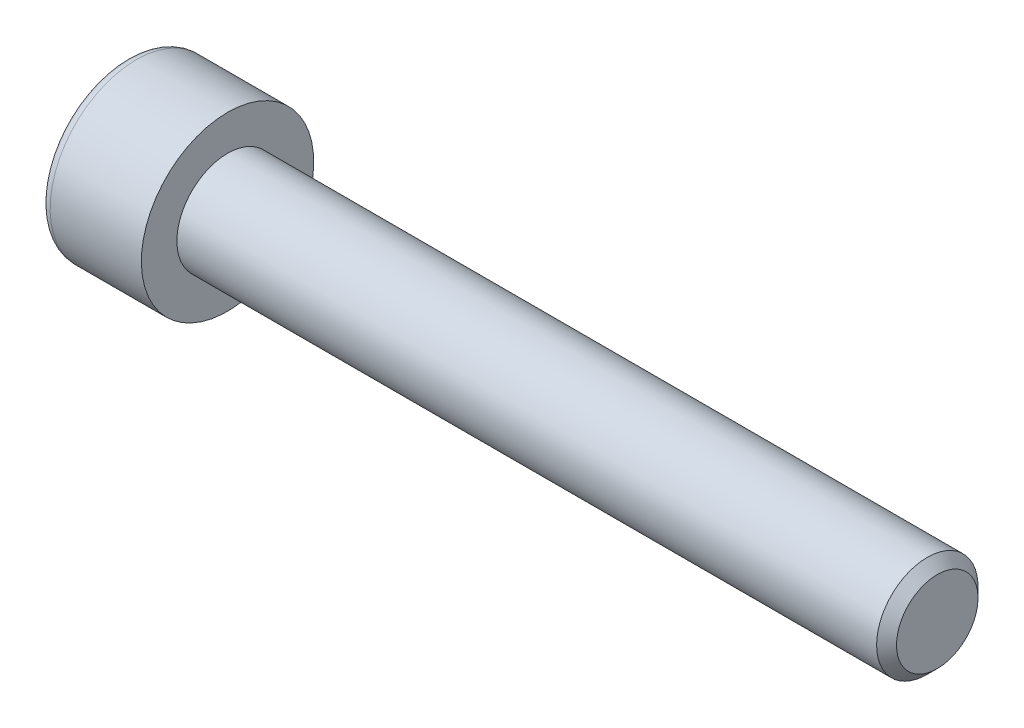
ISO-10303-21;
HEADER;
FILE_DESCRIPTION(('STEP AP214'),'2;1');
FILE_NAME('part.step','',(''),(''),'','','');
FILE_SCHEMA(('AUTOMOTIVE_DESIGN { 1 0 10303 214 1 1 1 1 }'));
ENDSEC;
DATA;
#1=APPLICATION_CONTEXT('core data for automotive mechanical design processes');
#2=APPLICATION_PROTOCOL_DEFINITION('international standard','automotive_design',2000,#1);
#3=PRODUCT_CONTEXT('',#1,'mechanical');
#4=PRODUCT('Part','Part','',(#3));
#5=PRODUCT_RELATED_PRODUCT_CATEGORY('part','',(#4));
#6=PRODUCT_DEFINITION_FORMATION('','',#4);
#7=PRODUCT_DEFINITION_CONTEXT('part definition',#1,'design');
#8=PRODUCT_DEFINITION('design','',#6,#7);
#9=PRODUCT_DEFINITION_SHAPE('','',#8);
#10=(LENGTH_UNIT() NAMED_UNIT(*) SI_UNIT(.MILLI.,.METRE.));
#11=(NAMED_UNIT(*) PLANE_ANGLE_UNIT() SI_UNIT($,.RADIAN.));
#12=(NAMED_UNIT(*) SI_UNIT($,.STERADIAN.) SOLID_ANGLE_UNIT());
#13=UNCERTAINTY_MEASURE_WITH_UNIT(LENGTH_MEASURE(1.E-05),#10,'distance_accuracy_value','');
#14=(GEOMETRIC_REPRESENTATION_CONTEXT(3) GLOBAL_UNCERTAINTY_ASSIGNED_CONTEXT((#13)) GLOBAL_UNIT_ASSIGNED_CONTEXT((#10,
#11,#12)) REPRESENTATION_CONTEXT('',''));
#15=CARTESIAN_POINT('',(0.,0.,0.));
#16=DIRECTION('',(0.,0.,1.));
#17=DIRECTION('',(1.,0.,0.));
#18=AXIS2_PLACEMENT_3D('',#15,#16,#17);
#19=CARTESIAN_POINT('',(-2.50800000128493,0.,0.));
#20=DIRECTION('',(-1.,0.,0.));
#21=DIRECTION('',(0.,0.,1.));
#22=AXIS2_PLACEMENT_3D('',#19,#20,#21);
#23=CONICAL_SURFACE('',#22,2.32325748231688,1.04719754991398);
#24=CARTESIAN_POINT('',(-1.16666666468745,-1.70530256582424E-10,0.));
#25=VERTEX_POINT('',#24);
#26=VERTEX_LOOP('',#25);
#27=FACE_BOUND('',#26,.T.);
#28=CARTESIAN_POINT('',(-2.50000000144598,2.00000000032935,1.15470053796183));
#29=CARTESIAN_POINT('',(-2.47069554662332,2.00000000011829,1.05321634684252));
#30=CARTESIAN_POINT('',(-2.44404467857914,2.00000000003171,0.950856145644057));
#31=CARTESIAN_POINT('',(-2.39752638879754,1.99999999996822,0.74436344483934));
#32=CARTESIAN_POINT('',(-2.37767542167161,1.99999999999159,0.640227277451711));
#33=CARTESIAN_POINT('',(-2.34677596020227,2.00000000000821,0.433245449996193));
#34=CARTESIAN_POINT('',(-2.33552178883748,2.00000000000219,0.330431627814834));
#35=CARTESIAN_POINT('',(-2.32208916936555,1.99999999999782,0.124320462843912));
#36=CARTESIAN_POINT('',(-2.31989959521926,1.99999999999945,0.0210238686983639));
#37=CARTESIAN_POINT('',(-2.32446629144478,2.00000000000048,-0.17197473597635));
#38=CARTESIAN_POINT('',(-2.33010128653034,2.00000000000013,-0.261705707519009));
#39=CARTESIAN_POINT('',(-2.34795730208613,1.99999999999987,-0.440583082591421));
#40=CARTESIAN_POINT('',(-2.36018441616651,1.99999999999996,-0.52972886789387));
#41=CARTESIAN_POINT('',(-2.39074983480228,2.00000000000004,-0.708974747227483));
#42=CARTESIAN_POINT('',(-2.40921764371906,2.00000000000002,-0.799052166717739));
#43=CARTESIAN_POINT('',(-2.45113176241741,1.99999999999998,-0.977863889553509));
#44=CARTESIAN_POINT('',(-2.47456823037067,1.99999999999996,-1.06660048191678));
#45=CARTESIAN_POINT('',(-2.50000000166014,2.,-1.15470053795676));
#46=B_SPLINE_CURVE_WITH_KNOTS('',3,(#28,#29,#30,#31,#32,#33,#34,#35,#36,#37,#38,#39,#40,#41,#42,
#43,#44,#45),.UNSPECIFIED.,.F.,.F.,(4,2,2,2,2,2,2,2,4),(0.,0.317016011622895,0.6347938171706,
0.944707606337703,1.25424088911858,1.52370778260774,1.79342419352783,2.06912162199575,
2.3442779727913),.UNSPECIFIED.);
#47=CARTESIAN_POINT('',(-2.50000000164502,1.99999999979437,1.15470053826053));
#48=VERTEX_POINT('',#47);
#49=CARTESIAN_POINT('',(-2.50000000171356,2.,-1.15470053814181));
#50=VERTEX_POINT('',#49);
#51=EDGE_CURVE('E20',#48,#50,#46,.T.);
#52=ORIENTED_EDGE('',*,*,#51,.T.);
#53=CARTESIAN_POINT('',(-2.50000000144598,1.99999999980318,-1.15470053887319));
#54=CARTESIAN_POINT('',(-2.47069554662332,1.91211211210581,-1.20544263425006));
#55=CARTESIAN_POINT('',(-2.44404467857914,1.82346557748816,-1.2566227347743));
#56=CARTESIAN_POINT('',(-2.39752638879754,1.64463765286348,-1.35986908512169));
#57=CARTESIAN_POINT('',(-2.37767542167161,1.55445308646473,-1.41193716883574));
#58=CARTESIAN_POINT('',(-2.34677596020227,1.37520156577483,-1.51542808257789));
#59=CARTESIAN_POINT('',(-2.33552178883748,1.28616218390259,-1.56683499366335));
#60=CARTESIAN_POINT('',(-2.32208916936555,1.10766467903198,-1.66989057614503));
#61=CARTESIAN_POINT('',(-2.31989959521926,1.01820720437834,-1.72153887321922));
#62=CARTESIAN_POINT('',(-2.32446629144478,0.851065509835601,-1.81803817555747));
#63=CARTESIAN_POINT('',(-2.33010128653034,0.773356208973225,-1.86290366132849));
#64=CARTESIAN_POINT('',(-2.34795730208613,0.61844385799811,-1.95234234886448));
#65=CARTESIAN_POINT('',(-2.36018441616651,0.541241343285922,-1.99691524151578));
#66=CARTESIAN_POINT('',(-2.39074983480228,0.38600985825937,-2.08653818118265));
#67=CARTESIAN_POINT('',(-2.40921764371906,0.30800052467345,-2.13157689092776));
#68=CARTESIAN_POINT('',(-2.45113176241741,0.153145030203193,-2.22098275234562));
#69=CARTESIAN_POINT('',(-2.47456823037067,0.0762968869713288,-2.26535104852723));
#70=CARTESIAN_POINT('',(-2.50000000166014,3.65892201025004E-10,-2.30940107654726));
#71=B_SPLINE_CURVE_WITH_KNOTS('',3,(#53,#54,#55,#56,#57,#58,#59,#60,#61,#62,#63,#64,#65,#66,#67,
#68,#69,#70),.UNSPECIFIED.,.F.,.F.,(4,2,2,2,2,2,2,2,4),(0.,0.317016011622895,0.634793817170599,
0.944707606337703,1.25424088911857,1.52370778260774,1.79342419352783,2.06912162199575,
2.3442779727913),.UNSPECIFIED.);
#72=CARTESIAN_POINT('',(-2.50000000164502,0.,-2.30940107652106));
#73=VERTEX_POINT('',#72);
#74=EDGE_CURVE('E80',#50,#73,#71,.T.);
#75=ORIENTED_EDGE('',*,*,#74,.T.);
#76=CARTESIAN_POINT('',(-2.50000000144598,-5.2617070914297E-10,-2.30940107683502));
#77=CARTESIAN_POINT('',(-2.47069554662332,-0.0878878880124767,-2.25865898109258));
#78=CARTESIAN_POINT('',(-2.44404467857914,-0.17653442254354,-2.20747888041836));
#79=CARTESIAN_POINT('',(-2.39752638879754,-0.355362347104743,-2.10423252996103));
#80=CARTESIAN_POINT('',(-2.37767542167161,-0.445546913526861,-2.05216444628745));
#81=CARTESIAN_POINT('',(-2.34677596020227,-0.624798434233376,-1.94867353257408));
#82=CARTESIAN_POINT('',(-2.33552178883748,-0.7138378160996,-1.89726662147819));
#83=CARTESIAN_POINT('',(-2.32208916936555,-0.892335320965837,-1.79421103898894));
#84=CARTESIAN_POINT('',(-2.31989959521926,-0.981792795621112,-1.74256274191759));
#85=CARTESIAN_POINT('',(-2.32446629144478,-1.14893449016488,-1.64606343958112));
#86=CARTESIAN_POINT('',(-2.33010128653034,-1.2266437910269,-1.60119795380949));
#87=CARTESIAN_POINT('',(-2.34795730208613,-1.38155614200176,-1.51175926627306));
#88=CARTESIAN_POINT('',(-2.36018441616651,-1.45875865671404,-1.46718637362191));
#89=CARTESIAN_POINT('',(-2.39074983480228,-1.61399014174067,-1.37756343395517));
#90=CARTESIAN_POINT('',(-2.40921764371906,-1.69199947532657,-1.33252472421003));
#91=CARTESIAN_POINT('',(-2.45113176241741,-1.84685496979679,-1.24311886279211));
#92=CARTESIAN_POINT('',(-2.47456823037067,-1.92370311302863,-1.19875056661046));
#93=CARTESIAN_POINT('',(-2.50000000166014,-1.99999999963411,-1.1547005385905));
#94=B_SPLINE_CURVE_WITH_KNOTS('',3,(#76,#77,#78,#79,#80,#81,#82,#83,#84,#85,#86,#87,#88,#89,#90,
#91,#92,#93),.UNSPECIFIED.,.F.,.F.,(4,2,2,2,2,2,2,2,4),(0.,0.317016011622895,0.634793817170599,
0.944707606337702,1.25424088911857,1.52370778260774,1.79342419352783,2.06912162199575,
2.3442779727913),.UNSPECIFIED.);
#95=CARTESIAN_POINT('',(-2.50000000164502,-1.99999999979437,-1.15470053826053));
#96=VERTEX_POINT('',#95);
#97=EDGE_CURVE('E105',#73,#96,#94,.T.);
#98=ORIENTED_EDGE('',*,*,#97,.T.);
#99=CARTESIAN_POINT('',(-2.50000000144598,-2.00000000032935,-1.15470053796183));
#100=CARTESIAN_POINT('',(-2.47069554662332,-2.00000000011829,-1.05321634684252));
#101=CARTESIAN_POINT('',(-2.44404467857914,-2.0000000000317,-0.95085614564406));
#102=CARTESIAN_POINT('',(-2.39752638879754,-1.99999999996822,-0.744363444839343));
#103=CARTESIAN_POINT('',(-2.37767542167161,-1.99999999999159,-0.640227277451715));
#104=CARTESIAN_POINT('',(-2.34677596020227,-2.00000000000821,-0.433245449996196));
#105=CARTESIAN_POINT('',(-2.33552178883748,-2.00000000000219,-0.330431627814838));
#106=CARTESIAN_POINT('',(-2.32208916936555,-1.99999999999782,-0.124320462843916));
#107=CARTESIAN_POINT('',(-2.31989959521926,-1.99999999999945,-0.0210238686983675));
#108=CARTESIAN_POINT('',(-2.32446629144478,-2.00000000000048,0.171974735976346));
#109=CARTESIAN_POINT('',(-2.33010128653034,-2.00000000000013,0.261705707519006));
#110=CARTESIAN_POINT('',(-2.34795730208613,-1.99999999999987,0.440583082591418));
#111=CARTESIAN_POINT('',(-2.36018441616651,-1.99999999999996,0.529728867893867));
#112=CARTESIAN_POINT('',(-2.39074983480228,-2.00000000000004,0.70897474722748));
#113=CARTESIAN_POINT('',(-2.40921764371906,-2.00000000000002,0.799052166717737));
#114=CARTESIAN_POINT('',(-2.45113176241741,-1.99999999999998,0.977863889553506));
#115=CARTESIAN_POINT('',(-2.47456823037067,-1.99999999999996,1.06660048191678));
#116=CARTESIAN_POINT('',(-2.50000000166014,-2.,1.15470053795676));
#117=B_SPLINE_CURVE_WITH_KNOTS('',3,(#99,#100,#101,#102,#103,#104,#105,#106,#107,#108,#109,#110,
#111,#112,#113,#114,#115,#116),.UNSPECIFIED.,.F.,.F.,(4,2,2,2,2,2,2,2,4),(0.,0.317016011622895,
0.634793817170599,0.944707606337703,1.25424088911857,1.52370778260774,1.79342419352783,
2.06912162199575,2.3442779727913),.UNSPECIFIED.);
#118=CARTESIAN_POINT('',(-2.50000000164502,-1.99999999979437,1.15470053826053));
#119=VERTEX_POINT('',#118);
#120=EDGE_CURVE('E129',#96,#119,#117,.T.);
#121=ORIENTED_EDGE('',*,*,#120,.T.);
#122=CARTESIAN_POINT('',(-2.50000000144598,-1.99999999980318,1.15470053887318));
#123=CARTESIAN_POINT('',(-2.47069554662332,-1.91211211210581,1.20544263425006));
#124=CARTESIAN_POINT('',(-2.44404467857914,-1.82346557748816,1.2566227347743));
#125=CARTESIAN_POINT('',(-2.39752638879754,-1.64463765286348,1.35986908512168));
#126=CARTESIAN_POINT('',(-2.37767542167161,-1.55445308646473,1.41193716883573));
#127=CARTESIAN_POINT('',(-2.34677596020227,-1.37520156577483,1.51542808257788));
#128=CARTESIAN_POINT('',(-2.33552178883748,-1.28616218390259,1.56683499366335));
#129=CARTESIAN_POINT('',(-2.32208916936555,-1.10766467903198,1.66989057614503));
#130=CARTESIAN_POINT('',(-2.31989959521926,-1.01820720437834,1.72153887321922));
#131=CARTESIAN_POINT('',(-2.32446629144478,-0.851065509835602,1.81803817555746));
#132=CARTESIAN_POINT('',(-2.33010128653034,-0.773356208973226,1.86290366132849));
#133=CARTESIAN_POINT('',(-2.34795730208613,-0.61844385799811,1.95234234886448));
#134=CARTESIAN_POINT('',(-2.36018441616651,-0.541241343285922,1.99691524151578));
#135=CARTESIAN_POINT('',(-2.39074983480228,-0.38600985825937,2.08653818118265));
#136=CARTESIAN_POINT('',(-2.40921764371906,-0.30800052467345,2.13157689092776));
#137=CARTESIAN_POINT('',(-2.45113176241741,-0.153145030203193,2.22098275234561));
#138=CARTESIAN_POINT('',(-2.47456823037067,-0.076296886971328,2.26535104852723));
#139=CARTESIAN_POINT('',(-2.50000000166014,-3.65891067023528E-10,2.30940107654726));
#140=B_SPLINE_CURVE_WITH_KNOTS('',3,(#122,#123,#124,#125,#126,#127,#128,#129,#130,#131,#132,
#133,#134,#135,#136,#137,#138,#139),.UNSPECIFIED.,.F.,.F.,(4,2,2,2,2,2,2,2,4),(0.,
0.317016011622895,0.634793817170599,0.944707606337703,1.25424088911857,1.52370778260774,
1.79342419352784,2.06912162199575,2.3442779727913),.UNSPECIFIED.);
#141=CARTESIAN_POINT('',(-2.50000000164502,0.,2.30940107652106));
#142=VERTEX_POINT('',#141);
#143=EDGE_CURVE('E137',#119,#142,#140,.T.);
#144=ORIENTED_EDGE('',*,*,#143,.T.);
#145=CARTESIAN_POINT('',(-2.50000000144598,5.26171169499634E-10,2.30940107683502));
#146=CARTESIAN_POINT('',(-2.47069554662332,0.087887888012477,2.25865898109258));
#147=CARTESIAN_POINT('',(-2.44404467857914,0.17653442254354,2.20747888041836));
#148=CARTESIAN_POINT('',(-2.39752638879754,0.355362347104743,2.10423252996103));
#149=CARTESIAN_POINT('',(-2.37767542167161,0.445546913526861,2.05216444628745));
#150=CARTESIAN_POINT('',(-2.34677596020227,0.624798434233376,1.94867353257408));
#151=CARTESIAN_POINT('',(-2.33552178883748,0.713837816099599,1.89726662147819));
#152=CARTESIAN_POINT('',(-2.32208916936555,0.892335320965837,1.79421103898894));
#153=CARTESIAN_POINT('',(-2.31989959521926,0.981792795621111,1.74256274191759));
#154=CARTESIAN_POINT('',(-2.32446629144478,1.14893449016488,1.64606343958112));
#155=CARTESIAN_POINT('',(-2.33010128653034,1.2266437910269,1.60119795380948));
#156=CARTESIAN_POINT('',(-2.34795730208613,1.38155614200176,1.51175926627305));
#157=CARTESIAN_POINT('',(-2.3601844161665,1.45875865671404,1.46718637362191));
#158=CARTESIAN_POINT('',(-2.39074983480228,1.61399014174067,1.37756343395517));
#159=CARTESIAN_POINT('',(-2.40921764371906,1.69199947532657,1.33252472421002));
#160=CARTESIAN_POINT('',(-2.45113176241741,1.84685496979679,1.2431188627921));
#161=CARTESIAN_POINT('',(-2.47456823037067,1.92370311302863,1.19875056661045));
#162=CARTESIAN_POINT('',(-2.50000000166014,1.99999999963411,1.1547005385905));
#163=B_SPLINE_CURVE_WITH_KNOTS('',3,(#145,#146,#147,#148,#149,#150,#151,#152,#153,#154,#155,
#156,#157,#158,#159,#160,#161,#162),.UNSPECIFIED.,.F.,.F.,(4,2,2,2,2,2,2,2,4),(0.,
0.317016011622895,0.634793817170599,0.944707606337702,1.25424088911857,1.52370778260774,
1.79342419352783,2.06912162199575,2.3442779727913),.UNSPECIFIED.);
#164=EDGE_CURVE('E82',#142,#48,#163,.T.);
#165=ORIENTED_EDGE('',*,*,#164,.T.);
#166=EDGE_LOOP('',(#52,#75,#98,#121,#144,#165));
#167=FACE_BOUND('',#166,.T.);
#168=ADVANCED_FACE('F16',(#27,#167),#23,.F.);
#169=CARTESIAN_POINT('',(-5.,2.,1.15470053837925));
#170=DIRECTION('',(0.,1.,0.));
#171=DIRECTION('',(0.,0.,1.));
#172=AXIS2_PLACEMENT_3D('',#169,#170,#171);
#173=PLANE('',#172);
#174=DIRECTION('',(1.,0.,0.));
#175=VECTOR('',#174,1.);
#176=CARTESIAN_POINT('',(-5.,2.,1.15470053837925));
#177=LINE('',#176,#175);
#178=CARTESIAN_POINT('',(-5.,2.,1.15470053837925));
#179=VERTEX_POINT('',#178);
#180=EDGE_CURVE('E84',#48,#179,#177,.F.);
#181=ORIENTED_EDGE('',*,*,#180,.T.);
#182=DIRECTION('',(0.,0.,1.));
#183=VECTOR('',#182,1.);
#184=CARTESIAN_POINT('',(-5.,2.,0.));
#185=LINE('',#184,#183);
#186=CARTESIAN_POINT('',(-5.,2.,-1.15470053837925));
#187=VERTEX_POINT('',#186);
#188=EDGE_CURVE('E89',#187,#179,#185,.T.);
#189=ORIENTED_EDGE('',*,*,#188,.F.);
#190=DIRECTION('',(1.,0.,0.));
#191=VECTOR('',#190,1.);
#192=CARTESIAN_POINT('',(-5.,2.,-1.15470053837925));
#193=LINE('',#192,#191);
#194=EDGE_CURVE('E87',#187,#50,#193,.T.);
#195=ORIENTED_EDGE('',*,*,#194,.T.);
#196=ORIENTED_EDGE('',*,*,#51,.F.);
#197=EDGE_LOOP('',(#181,#189,#195,#196));
#198=FACE_BOUND('',#197,.T.);
#199=ADVANCED_FACE('F76',(#198),#173,.F.);
#200=CARTESIAN_POINT('',(-5.,0.,2.3094010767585));
#201=DIRECTION('',(0.,0.500000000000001,0.866025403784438));
#202=DIRECTION('',(0.,-0.866025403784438,0.500000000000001));
#203=AXIS2_PLACEMENT_3D('',#200,#201,#202);
#204=PLANE('',#203);
#205=DIRECTION('',(1.,0.,0.));
#206=VECTOR('',#205,1.);
#207=CARTESIAN_POINT('',(-5.,0.,2.3094010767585));
#208=LINE('',#207,#206);
#209=CARTESIAN_POINT('',(-5.,0.,2.3094010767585));
#210=VERTEX_POINT('',#209);
#211=EDGE_CURVE('E141',#142,#210,#208,.F.);
#212=ORIENTED_EDGE('',*,*,#211,.T.);
#213=DIRECTION('',(0.,-0.866025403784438,0.5));
#214=VECTOR('',#213,1.);
#215=CARTESIAN_POINT('',(-5.,2.,1.15470053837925));
#216=LINE('',#215,#214);
#217=EDGE_CURVE('E95',#179,#210,#216,.T.);
#218=ORIENTED_EDGE('',*,*,#217,.F.);
#219=ORIENTED_EDGE('',*,*,#180,.F.);
#220=ORIENTED_EDGE('',*,*,#164,.F.);
#221=EDGE_LOOP('',(#212,#218,#219,#220));
#222=FACE_BOUND('',#221,.T.);
#223=ADVANCED_FACE('F145',(#222),#204,.F.);
#224=CARTESIAN_POINT('',(-5.,-2.,1.15470053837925));
#225=DIRECTION('',(0.,-0.5,0.866025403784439));
#226=DIRECTION('',(0.,-0.866025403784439,-0.5));
#227=AXIS2_PLACEMENT_3D('',#224,#225,#226);
#228=PLANE('',#227);
#229=DIRECTION('',(1.,0.,0.));
#230=VECTOR('',#229,1.);
#231=CARTESIAN_POINT('',(-5.,-2.,1.15470053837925));
#232=LINE('',#231,#230);
#233=CARTESIAN_POINT('',(-5.,-2.,1.15470053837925));
#234=VERTEX_POINT('',#233);
#235=EDGE_CURVE('E136',#119,#234,#232,.F.);
#236=ORIENTED_EDGE('',*,*,#235,.T.);
#237=DIRECTION('',(0.,-0.866025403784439,-0.5));
#238=VECTOR('',#237,1.);
#239=CARTESIAN_POINT('',(-5.,0.,2.3094010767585));
#240=LINE('',#239,#238);
#241=EDGE_CURVE('E224',#210,#234,#240,.T.);
#242=ORIENTED_EDGE('',*,*,#241,.F.);
#243=ORIENTED_EDGE('',*,*,#211,.F.);
#244=ORIENTED_EDGE('',*,*,#143,.F.);
#245=EDGE_LOOP('',(#236,#242,#243,#244));
#246=FACE_BOUND('',#245,.T.);
#247=ADVANCED_FACE('F125',(#246),#228,.F.);
#248=CARTESIAN_POINT('',(-5.,-2.,-1.15470053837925));
#249=DIRECTION('',(0.,-1.,0.));
#250=DIRECTION('',(0.,0.,-1.));
#251=AXIS2_PLACEMENT_3D('',#248,#249,#250);
#252=PLANE('',#251);
#253=DIRECTION('',(1.,0.,0.));
#254=VECTOR('',#253,1.);
#255=CARTESIAN_POINT('',(-5.,-2.,-1.15470053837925));
#256=LINE('',#255,#254);
#257=CARTESIAN_POINT('',(-5.,-2.,-1.15470053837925));
#258=VERTEX_POINT('',#257);
#259=EDGE_CURVE('E135',#96,#258,#256,.F.);
#260=ORIENTED_EDGE('',*,*,#259,.T.);
#261=DIRECTION('',(0.,0.,1.));
#262=VECTOR('',#261,1.);
#263=CARTESIAN_POINT('',(-5.,-2.,0.));
#264=LINE('',#263,#262);
#265=EDGE_CURVE('E221',#234,#258,#264,.F.);
#266=ORIENTED_EDGE('',*,*,#265,.F.);
#267=ORIENTED_EDGE('',*,*,#235,.F.);
#268=ORIENTED_EDGE('',*,*,#120,.F.);
#269=EDGE_LOOP('',(#260,#266,#267,#268));
#270=FACE_BOUND('',#269,.T.);
#271=ADVANCED_FACE('F121',(#270),#252,.F.);
#272=CARTESIAN_POINT('',(-5.,0.,-2.3094010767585));
#273=DIRECTION('',(0.,-0.5,-0.866025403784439));
#274=DIRECTION('',(0.,0.866025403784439,-0.5));
#275=AXIS2_PLACEMENT_3D('',#272,#273,#274);
#276=PLANE('',#275);
#277=DIRECTION('',(1.,0.,0.));
#278=VECTOR('',#277,1.);
#279=CARTESIAN_POINT('',(-5.,0.,-2.3094010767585));
#280=LINE('',#279,#278);
#281=CARTESIAN_POINT('',(-5.,0.,-2.3094010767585));
#282=VERTEX_POINT('',#281);
#283=EDGE_CURVE('E38',#73,#282,#280,.F.);
#284=ORIENTED_EDGE('',*,*,#283,.T.);
#285=DIRECTION('',(0.,0.866025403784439,-0.5));
#286=VECTOR('',#285,1.);
#287=CARTESIAN_POINT('',(-5.,-2.,-1.15470053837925));
#288=LINE('',#287,#286);
#289=EDGE_CURVE('E218',#258,#282,#288,.T.);
#290=ORIENTED_EDGE('',*,*,#289,.F.);
#291=ORIENTED_EDGE('',*,*,#259,.F.);
#292=ORIENTED_EDGE('',*,*,#97,.F.);
#293=EDGE_LOOP('',(#284,#290,#291,#292));
#294=FACE_BOUND('',#293,.T.);
#295=ADVANCED_FACE('F115',(#294),#276,.F.);
#296=CARTESIAN_POINT('',(-5.,2.,-1.15470053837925));
#297=DIRECTION('',(0.,0.5,-0.866025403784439));
#298=DIRECTION('',(0.,0.866025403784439,0.5));
#299=AXIS2_PLACEMENT_3D('',#296,#297,#298);
#300=PLANE('',#299);
#301=ORIENTED_EDGE('',*,*,#194,.F.);
#302=DIRECTION('',(0.,0.866025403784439,0.499999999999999));
#303=VECTOR('',#302,1.);
#304=CARTESIAN_POINT('',(-5.,0.,-2.3094010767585));
#305=LINE('',#304,#303);
#306=EDGE_CURVE('E216',#282,#187,#305,.T.);
#307=ORIENTED_EDGE('',*,*,#306,.F.);
#308=ORIENTED_EDGE('',*,*,#283,.F.);
#309=ORIENTED_EDGE('',*,*,#74,.F.);
#310=EDGE_LOOP('',(#301,#307,#308,#309));
#311=FACE_BOUND('',#310,.T.);
#312=ADVANCED_FACE('F93',(#311),#300,.F.);
#313=CARTESIAN_POINT('',(-5.,3.27970053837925,0.));
#314=DIRECTION('',(-1.,0.,0.));
#315=DIRECTION('',(0.,0.,1.));
#316=AXIS2_PLACEMENT_3D('',#313,#314,#315);
#317=PLANE('',#316);
#318=ORIENTED_EDGE('',*,*,#289,.T.);
#319=ORIENTED_EDGE('',*,*,#306,.T.);
#320=ORIENTED_EDGE('',*,*,#188,.T.);
#321=ORIENTED_EDGE('',*,*,#217,.T.);
#322=ORIENTED_EDGE('',*,*,#241,.T.);
#323=ORIENTED_EDGE('',*,*,#265,.T.);
#324=EDGE_LOOP('',(#318,#319,#320,#321,#322,#323));
#325=FACE_BOUND('',#324,.T.);
#326=CARTESIAN_POINT('',(-5.,0.,0.));
#327=DIRECTION('',(1.,0.,0.));
#328=DIRECTION('',(0.,1.,0.));
#329=AXIS2_PLACEMENT_3D('',#326,#327,#328);
#330=CIRCLE('',#329,3.75);
#331=CARTESIAN_POINT('',(-5.,3.75,0.));
#332=VERTEX_POINT('',#331);
#333=EDGE_CURVE('E193',#332,#332,#330,.T.);
#334=ORIENTED_EDGE('',*,*,#333,.F.);
#335=EDGE_LOOP('',(#334));
#336=FACE_BOUND('',#335,.T.);
#337=ADVANCED_FACE('F114',(#325,#336),#317,.T.);
#338=CARTESIAN_POINT('',(-4.5,0.,0.));
#339=DIRECTION('',(1.,0.,0.));
#340=DIRECTION('',(0.,0.,-1.));
#341=AXIS2_PLACEMENT_3D('',#338,#339,#340);
#342=TOROIDAL_SURFACE('',#341,3.75,0.5);
#343=CARTESIAN_POINT('',(-4.5,0.,0.));
#344=DIRECTION('',(1.,0.,0.));
#345=DIRECTION('',(0.,1.,0.));
#346=AXIS2_PLACEMENT_3D('',#343,#344,#345);
#347=CIRCLE('',#346,4.25);
#348=CARTESIAN_POINT('',(-4.5,4.25,0.));
#349=VERTEX_POINT('',#348);
#350=EDGE_CURVE('E234',#349,#349,#347,.T.);
#351=ORIENTED_EDGE('',*,*,#350,.F.);
#352=EDGE_LOOP('',(#351));
#353=FACE_BOUND('',#352,.T.);
#354=ORIENTED_EDGE('',*,*,#333,.T.);
#355=EDGE_LOOP('',(#354));
#356=FACE_BOUND('',#355,.T.);
#357=ADVANCED_FACE('F177',(#353,#356),#342,.T.);
#358=CARTESIAN_POINT('',(-2.5,0.,0.));
#359=DIRECTION('',(1.,0.,0.));
#360=DIRECTION('',(0.,1.,0.));
#361=AXIS2_PLACEMENT_3D('',#358,#359,#360);
#362=CYLINDRICAL_SURFACE('',#361,4.25);
#363=ORIENTED_EDGE('',*,*,#350,.T.);
#364=EDGE_LOOP('',(#363));
#365=FACE_BOUND('',#364,.T.);
#366=CARTESIAN_POINT('',(0.,0.,0.));
#367=DIRECTION('',(1.,0.,0.));
#368=DIRECTION('',(0.,1.,0.));
#369=AXIS2_PLACEMENT_3D('',#366,#367,#368);
#370=CIRCLE('',#369,4.25);
#371=CARTESIAN_POINT('',(0.,4.25,0.));
#372=VERTEX_POINT('',#371);
#373=EDGE_CURVE('E103',#372,#372,#370,.T.);
#374=ORIENTED_EDGE('',*,*,#373,.F.);
#375=EDGE_LOOP('',(#374));
#376=FACE_BOUND('',#375,.T.);
#377=ADVANCED_FACE('F174',(#365,#376),#362,.T.);
#378=CARTESIAN_POINT('',(35.,1.25,0.));
#379=DIRECTION('',(1.,0.,0.));
#380=DIRECTION('',(0.,0.,-1.));
#381=AXIS2_PLACEMENT_3D('',#378,#379,#380);
#382=PLANE('',#381);
#383=CARTESIAN_POINT('',(35.0000000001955,0.,0.));
#384=DIRECTION('',(-1.,0.,0.));
#385=DIRECTION('',(0.,0.,1.));
#386=AXIS2_PLACEMENT_3D('',#383,#384,#385);
#387=CIRCLE('',#386,2.0092400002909);
#388=CARTESIAN_POINT('',(35.0000000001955,0.,2.0092400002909));
#389=VERTEX_POINT('',#388);
#390=EDGE_CURVE('E230',#389,#389,#387,.T.);
#391=ORIENTED_EDGE('',*,*,#390,.F.);
#392=EDGE_LOOP('',(#391));
#393=FACE_BOUND('',#392,.T.);
#394=ADVANCED_FACE('F170',(#393),#382,.T.);
#395=CARTESIAN_POINT('',(0.,3.375,0.));
#396=DIRECTION('',(1.,0.,0.));
#397=DIRECTION('',(0.,0.,-1.));
#398=AXIS2_PLACEMENT_3D('',#395,#396,#397);
#399=PLANE('',#398);
#400=CARTESIAN_POINT('',(0.,0.,0.));
#401=DIRECTION('',(1.,0.,0.));
#402=DIRECTION('',(0.,1.,0.));
#403=AXIS2_PLACEMENT_3D('',#400,#401,#402);
#404=CIRCLE('',#403,2.5);
#405=CARTESIAN_POINT('',(0.,2.5,0.));
#406=VERTEX_POINT('',#405);
#407=EDGE_CURVE('E29',#406,#406,#404,.T.);
#408=ORIENTED_EDGE('',*,*,#407,.F.);
#409=EDGE_LOOP('',(#408));
#410=FACE_BOUND('',#409,.T.);
#411=ORIENTED_EDGE('',*,*,#373,.T.);
#412=EDGE_LOOP('',(#411));
#413=FACE_BOUND('',#412,.T.);
#414=ADVANCED_FACE('F163',(#410,#413),#399,.T.);
#415=CARTESIAN_POINT('',(34.5092399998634,0.,0.));
#416=DIRECTION('',(-1.,0.,0.));
#417=DIRECTION('',(0.,0.,1.));
#418=AXIS2_PLACEMENT_3D('',#415,#416,#417);
#419=CONICAL_SURFACE('',#418,2.49999999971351,0.78539816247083);
#420=ORIENTED_EDGE('',*,*,#390,.T.);
#421=EDGE_LOOP('',(#420));
#422=FACE_BOUND('',#421,.T.);
#423=CARTESIAN_POINT('',(34.50924,0.,0.));
#424=DIRECTION('',(1.,0.,0.));
#425=DIRECTION('',(0.,1.,0.));
#426=AXIS2_PLACEMENT_3D('',#423,#424,#425);
#427=CIRCLE('',#426,2.5);
#428=CARTESIAN_POINT('',(34.50924,2.5,0.));
#429=VERTEX_POINT('',#428);
#430=EDGE_CURVE('E11',#429,#429,#427,.F.);
#431=ORIENTED_EDGE('',*,*,#430,.F.);
#432=EDGE_LOOP('',(#431));
#433=FACE_BOUND('',#432,.T.);
#434=ADVANCED_FACE('F156',(#422,#433),#419,.T.);
#435=CARTESIAN_POINT('',(24.,0.,0.));
#436=DIRECTION('',(1.,0.,0.));
#437=DIRECTION('',(0.,1.,0.));
#438=AXIS2_PLACEMENT_3D('',#435,#436,#437);
#439=CYLINDRICAL_SURFACE('',#438,2.5);
#440=ORIENTED_EDGE('',*,*,#430,.T.);
#441=EDGE_LOOP('',(#440));
#442=FACE_BOUND('',#441,.T.);
#443=ORIENTED_EDGE('',*,*,#407,.T.);
#444=EDGE_LOOP('',(#443));
#445=FACE_BOUND('',#444,.T.);
#446=ADVANCED_FACE('F154',(#442,#445),#439,.T.);
#447=CLOSED_SHELL('',(#168,#199,#223,#247,#271,#295,#312,#337,#357,#377,#394,#414,#434,#446));
#448=MANIFOLD_SOLID_BREP('B1',#447);
#449=ADVANCED_BREP_SHAPE_REPRESENTATION('',(#18,#448),#14);
#450=SHAPE_DEFINITION_REPRESENTATION(#9,#449);
ENDSEC;
END-ISO-10303-21;
